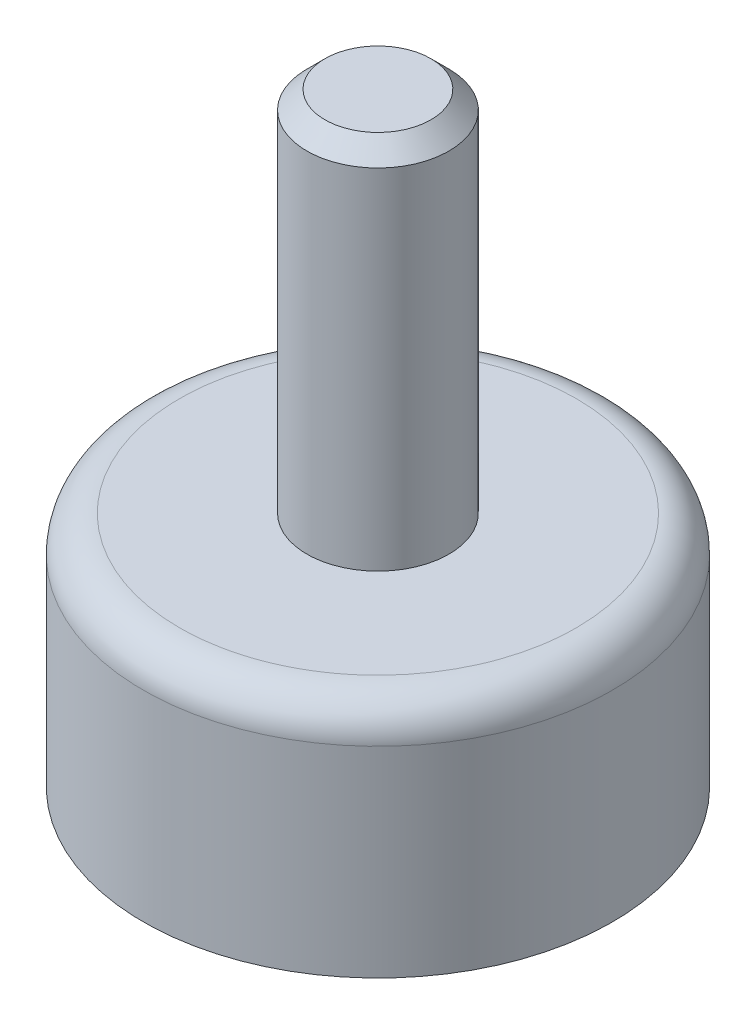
ISO-10303-21;
HEADER;
FILE_DESCRIPTION(('STEP AP214'),'2;1');
FILE_NAME('part.step','',(''),(''),'','','');
FILE_SCHEMA(('AUTOMOTIVE_DESIGN { 1 0 10303 214 1 1 1 1 }'));
ENDSEC;
DATA;
#1=APPLICATION_CONTEXT('core data for automotive mechanical design processes');
#2=APPLICATION_PROTOCOL_DEFINITION('international standard','automotive_design',2000,#1);
#3=PRODUCT_CONTEXT('',#1,'mechanical');
#4=PRODUCT('Part','Part','',(#3));
#5=PRODUCT_RELATED_PRODUCT_CATEGORY('part','',(#4));
#6=PRODUCT_DEFINITION_FORMATION('','',#4);
#7=PRODUCT_DEFINITION_CONTEXT('part definition',#1,'design');
#8=PRODUCT_DEFINITION('design','',#6,#7);
#9=PRODUCT_DEFINITION_SHAPE('','',#8);
#10=(LENGTH_UNIT() NAMED_UNIT(*) SI_UNIT(.MILLI.,.METRE.));
#11=(NAMED_UNIT(*) PLANE_ANGLE_UNIT() SI_UNIT($,.RADIAN.));
#12=(NAMED_UNIT(*) SI_UNIT($,.STERADIAN.) SOLID_ANGLE_UNIT());
#13=UNCERTAINTY_MEASURE_WITH_UNIT(LENGTH_MEASURE(1.E-05),#10,'distance_accuracy_value','');
#14=(GEOMETRIC_REPRESENTATION_CONTEXT(3) GLOBAL_UNCERTAINTY_ASSIGNED_CONTEXT((#13)) GLOBAL_UNIT_ASSIGNED_CONTEXT((#10,
#11,#12)) REPRESENTATION_CONTEXT('',''));
#15=CARTESIAN_POINT('',(0.,0.,0.));
#16=DIRECTION('',(0.,0.,1.));
#17=DIRECTION('',(1.,0.,0.));
#18=AXIS2_PLACEMENT_3D('',#15,#16,#17);
#19=CARTESIAN_POINT('',(0.,12.7540000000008,0.));
#20=DIRECTION('',(0.,-1.,0.));
#21=DIRECTION('',(0.,0.,-1.));
#22=AXIS2_PLACEMENT_3D('',#19,#20,#21);
#23=PLANE('',#22);
#24=CARTESIAN_POINT('',(0.,12.7540000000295,0.));
#25=DIRECTION('',(0.,-1.,0.));
#26=DIRECTION('',(0.,0.,-1.));
#27=AXIS2_PLACEMENT_3D('',#24,#25,#26);
#28=CIRCLE('',#27,1.11900000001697);
#29=CARTESIAN_POINT('',(0.,12.7540000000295,-1.11900000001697));
#30=VERTEX_POINT('',#29);
#31=EDGE_CURVE('E108',#30,#30,#28,.T.);
#32=ORIENTED_EDGE('',*,*,#31,.F.);
#33=EDGE_LOOP('',(#32));
#34=FACE_BOUND('',#33,.T.);
#35=ADVANCED_FACE('F17',(#34),#23,.F.);
#36=CARTESIAN_POINT('',(0.,12.3730000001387,0.));
#37=DIRECTION('',(0.,-1.,0.));
#38=DIRECTION('',(0.,0.,-1.));
#39=AXIS2_PLACEMENT_3D('',#36,#37,#38);
#40=CONICAL_SURFACE('',#39,1.49999999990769,0.785398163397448);
#41=ORIENTED_EDGE('',*,*,#31,.T.);
#42=EDGE_LOOP('',(#41));
#43=FACE_BOUND('',#42,.T.);
#44=CARTESIAN_POINT('',(0.,12.3730000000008,0.));
#45=DIRECTION('',(0.,-1.,0.));
#46=DIRECTION('',(0.,0.,-1.));
#47=AXIS2_PLACEMENT_3D('',#44,#45,#46);
#48=CIRCLE('',#47,1.50000000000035);
#49=CARTESIAN_POINT('',(0.,12.3730000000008,-1.50000000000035));
#50=VERTEX_POINT('',#49);
#51=EDGE_CURVE('E79',#50,#50,#48,.T.);
#52=ORIENTED_EDGE('',*,*,#51,.F.);
#53=EDGE_LOOP('',(#52));
#54=FACE_BOUND('',#53,.T.);
#55=ADVANCED_FACE('F117',(#43,#54),#40,.T.);
#56=CARTESIAN_POINT('',(0.,0.254,0.));
#57=DIRECTION('',(0.,-1.,0.));
#58=DIRECTION('',(0.,0.,-1.));
#59=AXIS2_PLACEMENT_3D('',#56,#57,#58);
#60=PLANE('',#59);
#61=CARTESIAN_POINT('',(0.,0.254000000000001,0.));
#62=DIRECTION('',(0.,-1.,0.));
#63=DIRECTION('',(0.,0.,-1.));
#64=AXIS2_PLACEMENT_3D('',#61,#62,#63);
#65=CIRCLE('',#64,4.064);
#66=CARTESIAN_POINT('',(0.,0.254000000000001,-4.064));
#67=VERTEX_POINT('',#66);
#68=EDGE_CURVE('E43',#67,#67,#65,.T.);
#69=ORIENTED_EDGE('',*,*,#68,.T.);
#70=EDGE_LOOP('',(#69));
#71=FACE_BOUND('',#70,.T.);
#72=ADVANCED_FACE('F119',(#71),#60,.T.);
#73=CARTESIAN_POINT('',(0.,13.3917000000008,0.));
#74=DIRECTION('',(0.,-1.,0.));
#75=DIRECTION('',(0.,0.,-1.));
#76=AXIS2_PLACEMENT_3D('',#73,#74,#75);
#77=CYLINDRICAL_SURFACE('',#76,1.50000000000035);
#78=CARTESIAN_POINT('',(0.,5.00000000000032,0.));
#79=DIRECTION('',(0.,-1.,0.));
#80=DIRECTION('',(0.,0.,-1.));
#81=AXIS2_PLACEMENT_3D('',#78,#79,#80);
#82=CIRCLE('',#81,1.50000000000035);
#83=CARTESIAN_POINT('',(0.,5.00000000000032,-1.50000000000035));
#84=VERTEX_POINT('',#83);
#85=EDGE_CURVE('E42',#84,#84,#82,.F.);
#86=ORIENTED_EDGE('',*,*,#85,.T.);
#87=EDGE_LOOP('',(#86));
#88=FACE_BOUND('',#87,.T.);
#89=ORIENTED_EDGE('',*,*,#51,.T.);
#90=EDGE_LOOP('',(#89));
#91=FACE_BOUND('',#90,.T.);
#92=ADVANCED_FACE('F115',(#88,#91),#77,.T.);
#93=CARTESIAN_POINT('',(0.,13.3917000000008,0.));
#94=DIRECTION('',(0.,-1.,0.));
#95=DIRECTION('',(0.,0.,-1.));
#96=AXIS2_PLACEMENT_3D('',#93,#94,#95);
#97=CYLINDRICAL_SURFACE('',#96,4.064);
#98=CARTESIAN_POINT('',(0.,0.,0.));
#99=DIRECTION('',(0.,-1.,0.));
#100=DIRECTION('',(0.,0.,-1.));
#101=AXIS2_PLACEMENT_3D('',#98,#99,#100);
#102=CIRCLE('',#101,4.064);
#103=CARTESIAN_POINT('',(0.,0.,-4.064));
#104=VERTEX_POINT('',#103);
#105=EDGE_CURVE('E47',#104,#104,#102,.F.);
#106=ORIENTED_EDGE('',*,*,#105,.F.);
#107=EDGE_LOOP('',(#106));
#108=FACE_BOUND('',#107,.T.);
#109=ORIENTED_EDGE('',*,*,#68,.F.);
#110=EDGE_LOOP('',(#109));
#111=FACE_BOUND('',#110,.T.);
#112=ADVANCED_FACE('F64',(#108,#111),#97,.F.);
#113=CARTESIAN_POINT('',(0.,5.00000000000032,0.));
#114=DIRECTION('',(0.,-1.,0.));
#115=DIRECTION('',(0.,0.,-1.));
#116=AXIS2_PLACEMENT_3D('',#113,#114,#115);
#117=PLANE('',#116);
#118=ORIENTED_EDGE('',*,*,#85,.F.);
#119=EDGE_LOOP('',(#118));
#120=FACE_BOUND('',#119,.T.);
#121=CARTESIAN_POINT('',(0.,5.00000000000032,0.));
#122=DIRECTION('',(0.,-1.,0.));
#123=DIRECTION('',(0.,0.,1.));
#124=AXIS2_PLACEMENT_3D('',#121,#122,#123);
#125=CIRCLE('',#124,4.191);
#126=CARTESIAN_POINT('',(0.,5.00000000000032,4.191));
#127=VERTEX_POINT('',#126);
#128=CARTESIAN_POINT('',(0.,5.00000000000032,-4.191));
#129=VERTEX_POINT('',#128);
#130=EDGE_CURVE('E40',#127,#129,#125,.T.);
#131=ORIENTED_EDGE('',*,*,#130,.F.);
#132=CARTESIAN_POINT('',(0.,5.00000000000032,-4.191));
#133=CARTESIAN_POINT('',(0.0783716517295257,5.00000000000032,-4.19100248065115));
#134=CARTESIAN_POINT('',(0.156743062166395,5.00000000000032,-4.18880177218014));
#135=CARTESIAN_POINT('',(0.313239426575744,5.00000000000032,-4.1800117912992));
#136=CARTESIAN_POINT('',(0.391364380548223,5.00000000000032,-4.17342251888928));
#137=CARTESIAN_POINT('',(0.547121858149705,5.00000000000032,-4.15587322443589));
#138=CARTESIAN_POINT('',(0.624754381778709,5.00000000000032,-4.14491320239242));
#139=CARTESIAN_POINT('',(0.779282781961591,5.00000000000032,-4.11865767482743));
#140=CARTESIAN_POINT('',(0.856178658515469,5.00000000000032,-4.1033621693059));
#141=CARTESIAN_POINT('',(1.00899180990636,5.00000000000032,-4.06848359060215));
#142=CARTESIAN_POINT('',(1.08490908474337,5.00000000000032,-4.04890051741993));
#143=CARTESIAN_POINT('',(1.23552617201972,5.00000000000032,-4.0055084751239));
#144=CARTESIAN_POINT('',(1.31022598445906,5.00000000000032,-3.98169950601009));
#145=CARTESIAN_POINT('',(1.45817311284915,5.00000000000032,-3.92993056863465));
#146=CARTESIAN_POINT('',(1.5314204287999,5.00000000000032,-3.901970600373));
#147=CARTESIAN_POINT('',(1.67623210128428,5.00000000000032,-3.8419876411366));
#148=CARTESIAN_POINT('',(1.74779645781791,5.00000000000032,-3.80996465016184));
#149=CARTESIAN_POINT('',(1.88901704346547,5.00000000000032,-3.74195640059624));
#150=CARTESIAN_POINT('',(1.9586732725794,5.00000000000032,-3.70597114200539));
#151=CARTESIAN_POINT('',(2.09585843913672,5.00000000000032,-3.63015158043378));
#152=CARTESIAN_POINT('',(2.1633873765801,5.00000000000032,-3.59031727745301));
#153=CARTESIAN_POINT('',(2.29610548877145,5.00000000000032,-3.50692496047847));
#154=CARTESIAN_POINT('',(2.36129466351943,5.00000000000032,-3.46336694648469));
#155=CARTESIAN_POINT('',(2.4891281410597,5.00000000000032,-3.37266425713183));
#156=CARTESIAN_POINT('',(2.55177244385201,5.00000000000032,-3.32551958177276));
#157=CARTESIAN_POINT('',(2.6743190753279,5.00000000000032,-3.22779190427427));
#158=CARTESIAN_POINT('',(2.73422140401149,5.00000000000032,-3.17720890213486));
#159=CARTESIAN_POINT('',(2.85109561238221,5.00000000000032,-3.07276372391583));
#160=CARTESIAN_POINT('',(2.90806749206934,5.00000000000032,-3.01890154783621));
#161=CARTESIAN_POINT('',(3.0189015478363,5.00000000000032,-2.90806749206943));
#162=CARTESIAN_POINT('',(3.07276372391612,5.00000000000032,-2.85109561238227));
#163=CARTESIAN_POINT('',(3.17720890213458,5.00000000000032,-2.73422140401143));
#164=CARTESIAN_POINT('',(3.22779190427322,5.00000000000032,-2.67431907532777));
#165=CARTESIAN_POINT('',(3.32551958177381,5.00000000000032,-2.55177244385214));
#166=CARTESIAN_POINT('',(3.37266425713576,5.00000000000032,-2.48912814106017));
#167=CARTESIAN_POINT('',(3.46336694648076,5.00000000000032,-2.36129466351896));
#168=CARTESIAN_POINT('',(3.50692496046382,5.00000000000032,-2.29610548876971));
#169=CARTESIAN_POINT('',(3.59031727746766,5.00000000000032,-2.16338737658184));
#170=CARTESIAN_POINT('',(3.63015158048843,5.00000000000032,-2.09585843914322));
#171=CARTESIAN_POINT('',(3.70597114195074,5.00000000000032,-1.9586732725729));
#172=CARTESIAN_POINT('',(3.74195640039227,5.0000000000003,-1.8890170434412));
#173=CARTESIAN_POINT('',(3.80996465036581,5.00000000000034,-1.74779645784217));
#174=CARTESIAN_POINT('',(3.84198764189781,5.00000000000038,-1.67623210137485));
#175=CARTESIAN_POINT('',(3.9019705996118,5.00000000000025,-1.53142042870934));
#176=CARTESIAN_POINT('',(3.92993056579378,5.00000000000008,-1.45817311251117));
#177=CARTESIAN_POINT('',(3.98169950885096,5.00000000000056,-1.31022598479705));
#178=CARTESIAN_POINT('',(4.00550848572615,5.00000000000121,-1.23552617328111));
#179=CARTESIAN_POINT('',(4.04890050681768,4.99999999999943,-1.08490908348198));
#180=CARTESIAN_POINT('',(4.06848355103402,4.99999999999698,-1.00899180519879));
#181=CARTESIAN_POINT('',(4.10336220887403,5.00000000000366,-0.856178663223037));
#182=CARTESIAN_POINT('',(4.11865782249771,5.00000000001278,-0.779282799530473));
#183=CARTESIAN_POINT('',(4.14491305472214,4.99999999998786,-0.624754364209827));
#184=CARTESIAN_POINT('',(4.15587267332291,4.99999999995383,-0.547121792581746));
#185=CARTESIAN_POINT('',(4.17342307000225,5.00000000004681,-0.391364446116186));
#186=CARTESIAN_POINT('',(4.18001384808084,5.00000000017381,-0.313239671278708));
#187=CARTESIAN_POINT('',(4.1887997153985,4.99999999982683,-0.156742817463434));
#188=CARTESIAN_POINT('',(4.19099480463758,4.99999999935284,-0.078370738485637));
#189=CARTESIAN_POINT('',(4.19100498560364,5.00000000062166,0.0752065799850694));
#190=CARTESIAN_POINT('',(4.18899333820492,5.00000000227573,0.150411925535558));
#191=CARTESIAN_POINT('',(4.18097280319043,4.99999999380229,0.300613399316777));
#192=CARTESIAN_POINT('',(4.17496386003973,4.99999998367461,0.375609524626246));
#193=CARTESIAN_POINT('',(4.16093793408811,4.99999995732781,0.506472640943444));
#194=CARTESIAN_POINT('',(4.15379820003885,4.99999994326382,0.562435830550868));
#195=CARTESIAN_POINT('',(4.13733539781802,4.99999983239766,0.67404737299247));
#196=CARTESIAN_POINT('',(4.12801223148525,4.99999973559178,0.729695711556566));
#197=CARTESIAN_POINT('',(4.10933696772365,4.9999996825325,0.828017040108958));
#198=CARTESIAN_POINT('',(4.10046673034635,4.99999969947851,0.870782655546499));
#199=CARTESIAN_POINT('',(4.07180413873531,4.99999977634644,0.99870338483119));
#200=CARTESIAN_POINT('',(4.04997072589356,4.99999986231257,1.08341394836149));
#201=CARTESIAN_POINT('',(4.01476591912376,4.99999993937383,1.20424623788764));
#202=CARTESIAN_POINT('',(4.00350720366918,4.99999995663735,1.24099959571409));
#203=CARTESIAN_POINT('',(3.9816717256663,4.99999997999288,1.3089497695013));
#204=CARTESIAN_POINT('',(3.97122787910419,4.9999999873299,1.34018919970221));
#205=CARTESIAN_POINT('',(3.94042406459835,5.00000000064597,1.42887569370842));
#206=CARTESIAN_POINT('',(3.91918366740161,5.00000000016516,1.4860198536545));
#207=CARTESIAN_POINT('',(3.88173564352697,4.99999999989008,1.58057913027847));
#208=CARTESIAN_POINT('',(3.86619163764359,4.99999999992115,1.61825907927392));
#209=CARTESIAN_POINT('',(3.83400254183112,4.99999999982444,1.69314560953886));
#210=CARTESIAN_POINT('',(3.8173574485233,4.99999999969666,1.73035218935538));
#211=CARTESIAN_POINT('',(3.76580605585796,4.99999999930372,1.84121909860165));
#212=CARTESIAN_POINT('',(3.72928055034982,4.99999999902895,1.91413441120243));
#213=CARTESIAN_POINT('',(3.65203768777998,4.99999999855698,2.05770436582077));
#214=CARTESIAN_POINT('',(3.61132031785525,4.99999999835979,2.12835900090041));
#215=CARTESIAN_POINT('',(3.52583202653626,4.99999999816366,2.26717353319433));
#216=CARTESIAN_POINT('',(3.48106110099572,4.99999999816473,2.33533342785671));
#217=CARTESIAN_POINT('',(3.38761841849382,4.99999999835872,2.46892421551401));
#218=CARTESIAN_POINT('',(3.33894666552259,4.99999999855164,2.53435511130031));
#219=CARTESIAN_POINT('',(3.23786851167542,4.99999999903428,2.66226536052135));
#220=CARTESIAN_POINT('',(3.18546212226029,4.999999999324,2.72474472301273));
#221=CARTESIAN_POINT('',(3.07709246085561,4.99999999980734,2.84653852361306));
#222=CARTESIAN_POINT('',(3.0211292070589,5.00000000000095,2.9058529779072));
#223=CARTESIAN_POINT('',(2.90796146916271,4.99999999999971,3.01899490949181));
#224=CARTESIAN_POINT('',(2.85087847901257,4.99999999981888,3.07294398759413));
#225=CARTESIAN_POINT('',(2.73377390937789,4.99999999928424,3.17755238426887));
#226=CARTESIAN_POINT('',(2.67375234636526,4.99999999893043,3.22821172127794));
#227=CARTESIAN_POINT('',(2.55095971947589,4.99999999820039,3.32607999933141));
#228=CARTESIAN_POINT('',(2.48818866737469,4.99999999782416,3.37328895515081));
#229=CARTESIAN_POINT('',(2.36009511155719,4.99999999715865,3.46410785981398));
#230=CARTESIAN_POINT('',(2.29477261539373,4.99999999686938,3.50771781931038));
#231=CARTESIAN_POINT('',(2.16178217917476,4.99999999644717,3.59120115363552));
#232=CARTESIAN_POINT('',(2.0941142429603,4.99999999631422,3.63107453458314));
#233=CARTESIAN_POINT('',(1.95664634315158,4.99999999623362,3.7069589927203));
#234=CARTESIAN_POINT('',(1.88684638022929,4.99999999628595,3.74297007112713));
#235=CARTESIAN_POINT('',(1.74533456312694,4.99999999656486,3.81101635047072));
#236=CARTESIAN_POINT('',(1.67362270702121,4.99999999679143,3.84305154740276));
#237=CARTESIAN_POINT('',(1.52851323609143,4.99999999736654,3.90304503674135));
#238=CARTESIAN_POINT('',(1.4551156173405,4.99999999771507,3.93100331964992));
#239=CARTESIAN_POINT('',(1.30686617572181,4.99999999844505,3.9827547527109));
#240=CARTESIAN_POINT('',(1.23201434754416,4.9999999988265,4.00654788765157));
#241=CARTESIAN_POINT('',(1.08109221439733,4.99999999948,4.04989409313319));
#242=CARTESIAN_POINT('',(1.00502190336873,4.99999999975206,4.06944714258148));
#243=CARTESIAN_POINT('',(0.851903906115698,5.00000000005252,4.10425096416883));
#244=CARTESIAN_POINT('',(0.7748562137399,5.00000000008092,4.11950170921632));
#245=CARTESIAN_POINT('',(0.620021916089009,4.99999999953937,4.14565465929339));
#246=CARTESIAN_POINT('',(0.542235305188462,4.99999999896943,4.15655683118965));
#247=CARTESIAN_POINT('',(0.415850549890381,4.99999999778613,4.17066066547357));
#248=CARTESIAN_POINT('',(0.3673989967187,4.99999999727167,4.17521413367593));
#249=CARTESIAN_POINT('',(0.270365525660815,4.99999999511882,4.18264047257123));
#250=CARTESIAN_POINT('',(0.221783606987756,4.99999999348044,4.1855133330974));
#251=CARTESIAN_POINT('',(0.115478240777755,4.99999999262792,4.18990911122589));
#252=CARTESIAN_POINT('',(0.0577401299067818,4.99999999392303,4.19108022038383));
#253=CARTESIAN_POINT('',(0.,5.00000000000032,4.191));
#254=B_SPLINE_CURVE_WITH_KNOTS('',3,(#132,#133,#134,#135,#136,#137,#138,#139,#140,#141,#142,
#143,#144,#145,#146,#147,#148,#149,#150,#151,#152,#153,#154,#155,#156,#157,#158,#159,#160,#161,
#162,#163,#164,#165,#166,#167,#168,#169,#170,#171,#172,#173,#174,#175,#176,#177,#178,#179,#180,
#181,#182,#183,#184,#185,#186,#187,#188,#189,#190,#191,#192,#193,#194,#195,#196,#197,#198,#199,
#200,#201,#202,#203,#204,#205,#206,#207,#208,#209,#210,#211,#212,#213,#214,#215,#216,#217,#218,
#219,#220,#221,#222,#223,#224,#225,#226,#227,#228,#229,#230,#231,#232,#233,#234,#235,#236,#237,
#238,#239,#240,#241,#242,#243,#244,#245,#246,#247,#248,#249,#250,#251,#252,#253),.UNSPECIFIED.,
.F.,.F.,(4,2,2,2,2,2,2,2,2,2,2,2,2,2,2,2,2,2,2,2,2,2,2,2,2,2,2,2,2,2,2,2,2,2,2,2,2,2,2,2,2,2,2,
2,2,2,2,2,2,2,2,2,2,2,2,2,2,2,2,2,4),(0.,0.235083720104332,0.470167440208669,0.705251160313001,
0.940334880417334,1.17541860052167,1.410502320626,1.64558604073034,1.88066976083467,
2.115753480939,2.35083720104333,2.58592092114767,2.821004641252,3.05608836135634,
3.29117208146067,3.526255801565,3.76133952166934,3.99642324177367,4.23150696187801,
4.46659068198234,4.70167440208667,4.93675812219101,5.17184184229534,5.40692556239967,
5.64200928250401,5.87709300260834,6.11217672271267,6.34726044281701,6.58234416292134,
6.80793655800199,7.03353208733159,7.2027431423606,7.37196180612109,7.50297170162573,
7.76519898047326,7.88050602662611,7.97931481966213,8.16214378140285,8.28440882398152,
8.40667424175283,8.65117990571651,8.89568631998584,9.14019298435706,9.38469939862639,
9.62920506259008,9.87370947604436,10.1092148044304,10.3447188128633,10.5802218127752,
10.8157241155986,11.0512260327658,11.2867278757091,11.5222299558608,11.7577325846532,
11.9932360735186,12.2287407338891,12.464246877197,12.6997548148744,12.8457239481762,
12.991693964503,13.1648945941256),.UNSPECIFIED.);
#255=EDGE_CURVE('E34',#129,#127,#254,.T.);
#256=ORIENTED_EDGE('',*,*,#255,.F.);
#257=EDGE_LOOP('',(#131,#256));
#258=FACE_BOUND('',#257,.T.);
#259=ADVANCED_FACE('F46',(#120,#258),#117,.F.);
#260=CARTESIAN_POINT('',(0.,0.,0.));
#261=DIRECTION('',(0.,-1.,0.));
#262=DIRECTION('',(0.,0.,-1.));
#263=AXIS2_PLACEMENT_3D('',#260,#261,#262);
#264=PLANE('',#263);
#265=ORIENTED_EDGE('',*,*,#105,.T.);
#266=EDGE_LOOP('',(#265));
#267=FACE_BOUND('',#266,.T.);
#268=CARTESIAN_POINT('',(0.,0.,0.));
#269=DIRECTION('',(0.,-1.,0.));
#270=DIRECTION('',(0.,0.,-1.));
#271=AXIS2_PLACEMENT_3D('',#268,#269,#270);
#272=CIRCLE('',#271,4.953);
#273=CARTESIAN_POINT('',(0.,0.,-4.953));
#274=VERTEX_POINT('',#273);
#275=EDGE_CURVE('E27',#274,#274,#272,.F.);
#276=ORIENTED_EDGE('',*,*,#275,.F.);
#277=EDGE_LOOP('',(#276));
#278=FACE_BOUND('',#277,.T.);
#279=ADVANCED_FACE('F63',(#267,#278),#264,.T.);
#280=CARTESIAN_POINT('',(0.,4.23800000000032,0.));
#281=DIRECTION('',(0.,-1.,0.));
#282=DIRECTION('',(0.0413174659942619,0.,0.999146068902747));
#283=AXIS2_PLACEMENT_3D('',#280,#281,#282);
#284=TOROIDAL_SURFACE('',#283,4.191,0.762);
#285=ORIENTED_EDGE('',*,*,#130,.T.);
#286=ORIENTED_EDGE('',*,*,#255,.T.);
#287=EDGE_LOOP('',(#285,#286));
#288=FACE_BOUND('',#287,.T.);
#289=CARTESIAN_POINT('',(0.,4.23800000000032,0.));
#290=DIRECTION('',(0.,-1.,0.));
#291=DIRECTION('',(0.,0.,-1.));
#292=AXIS2_PLACEMENT_3D('',#289,#290,#291);
#293=CIRCLE('',#292,4.953);
#294=CARTESIAN_POINT('',(0.,4.23800000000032,-4.953));
#295=VERTEX_POINT('',#294);
#296=EDGE_CURVE('E11',#295,#295,#293,.T.);
#297=ORIENTED_EDGE('',*,*,#296,.F.);
#298=EDGE_LOOP('',(#297));
#299=FACE_BOUND('',#298,.T.);
#300=ADVANCED_FACE('F38',(#288,#299),#284,.T.);
#301=CARTESIAN_POINT('',(0.,13.3917000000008,0.));
#302=DIRECTION('',(0.,-1.,0.));
#303=DIRECTION('',(0.,0.,-1.));
#304=AXIS2_PLACEMENT_3D('',#301,#302,#303);
#305=CYLINDRICAL_SURFACE('',#304,4.953);
#306=ORIENTED_EDGE('',*,*,#275,.T.);
#307=EDGE_LOOP('',(#306));
#308=FACE_BOUND('',#307,.T.);
#309=ORIENTED_EDGE('',*,*,#296,.T.);
#310=EDGE_LOOP('',(#309));
#311=FACE_BOUND('',#310,.T.);
#312=ADVANCED_FACE('F89',(#308,#311),#305,.T.);
#313=CLOSED_SHELL('',(#35,#55,#72,#92,#112,#259,#279,#300,#312));
#314=MANIFOLD_SOLID_BREP('B1',#313);
#315=ADVANCED_BREP_SHAPE_REPRESENTATION('',(#18,#314),#14);
#316=SHAPE_DEFINITION_REPRESENTATION(#9,#315);
ENDSEC;
END-ISO-10303-21;
